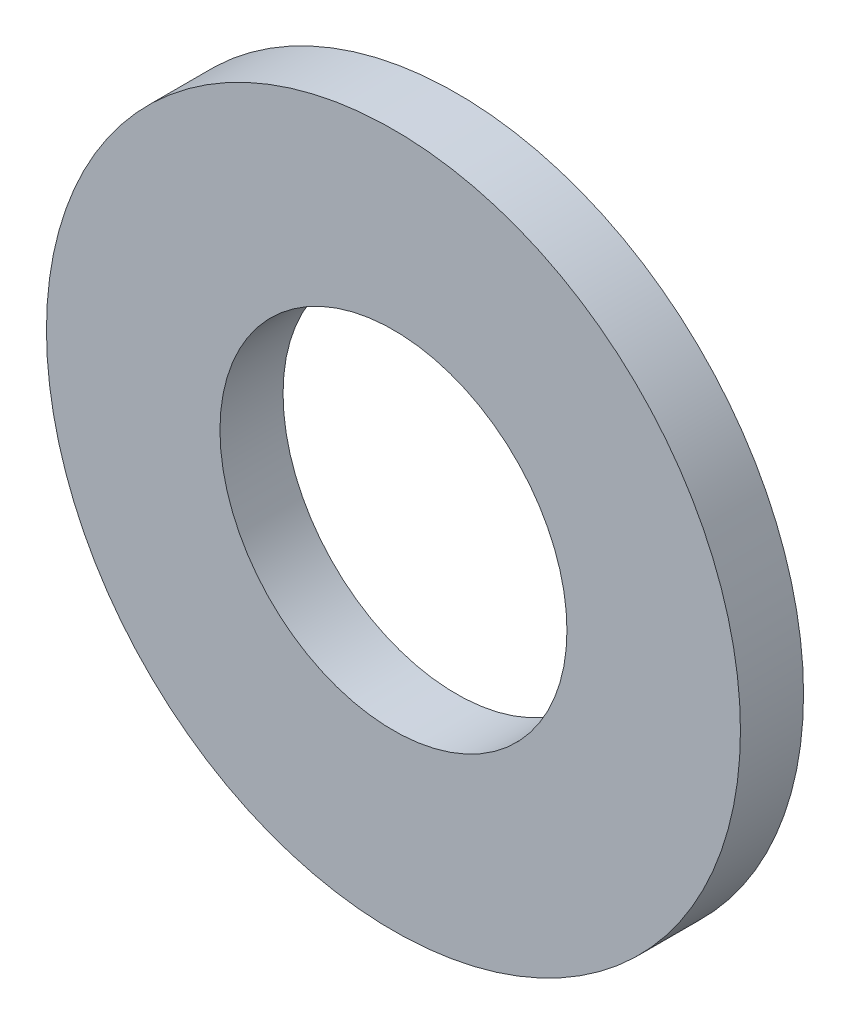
from build123d import *

# Parameters (mm, degrees)
ESQUISSE1_W = 5.5
ESQUISSE1_H = 2


with BuildPart() as part:
    # Esquisse1 → R_volution1 (revolve)
    with BuildSketch(Plane(origin=(0, 0, 0), x_dir=(1, 0, 0), z_dir=(0, 1, 0))):
        with Locations((8.25, -1)):
            Rectangle(ESQUISSE1_W, ESQUISSE1_H)
    revolve(axis=Axis((0, 0, 0), (0, 0, 1)))


solid = part.part
